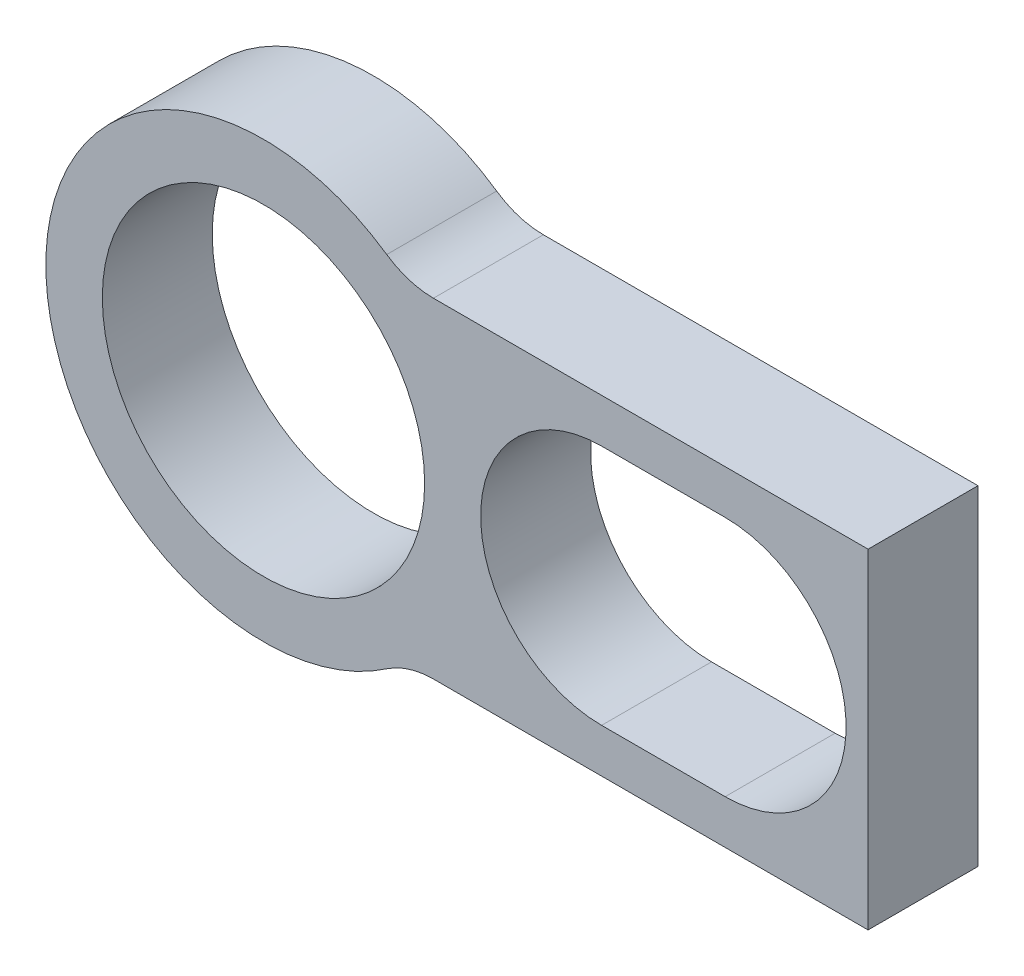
from build123d import *
from build123d.topology import SkipClean

# Parameters (mm, degrees)
SKETCH1_R          = 9.3726
EXTRUDE1_DEPTH     = 3.175
CUT_EXTRUDE2_DEPTH = 38.658444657
CUT_EXTRUDE1_DEPTH = 38.658444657
FILLET3_R          = 4.7625
FILLET4_R          = 4.7625
EXTRUDE3_START     = -6.35
EXTRUDE3_DEPTH     = 6.35


with BuildPart() as part:
    # Sketch1 → Extrude1 (new, symmetric)
    with BuildSketch(Plane.XY):
        with BuildLine():
            Line((0, 12.573), (34.925, 12.573))
            Line((34.925, 12.573), (34.925, -12.573))
            Line((34.925, -12.573), (0, -12.573))
            ThreePointArc((0, -12.573), (-12.573, 0), (0, 12.573))
        make_face()
        Circle(SKETCH1_R, mode=Mode.SUBTRACT)
    extrude(amount=EXTRUDE1_DEPTH, both=True)

    # Sketch7 → Cut-Extrude2 (cut, through all)
    with SkipClean():  # the faces are left unmerged after this step: merging them gives an invalid solid
        with BuildSketch(Plane(origin=(0, 0, -3.175), x_dir=(-1, 0, 0), z_dir=(0, 0, -1))):
            with BuildLine():
                Line((-34.925, 9.525), (-8.206991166, 9.525))
                ThreePointArc((-8.206991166, 9.525), (-4.377356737, 11.786393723), (0, 12.573))
                Line((0, 12.573), (-34.925, 12.573))
                Line((-34.925, 12.573), (-34.925, 9.525))
            make_face()
            with BuildLine():
                Line((-34.925, -12.573), (-34.925, -9.525))
                Line((-34.925, -9.525), (-8.206991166, -9.525))
                ThreePointArc((-8.206991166, -9.525), (-4.377356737, -11.786393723), (0, -12.573))
                Line((0, -12.573), (-34.925, -12.573))
            make_face()
        extrude(amount=-CUT_EXTRUDE2_DEPTH, mode=Mode.SUBTRACT)

    # Sketch6 → Cut-Extrude1 (cut, through all)
    with SkipClean():  # the faces are left unmerged after this step: merging them gives an invalid solid
        with BuildSketch(Plane(origin=(0, 0, -3.175), x_dir=(-1, 0, 0), z_dir=(0, 0, -1))):
            with BuildLine():
                Line((-26.67, 6.985), (-19.5326, 6.985))
                ThreePointArc((-19.5326, 6.985), (-12.5476, 0), (-19.5326, -6.985))
                Line((-19.5326, -6.985), (-26.67, -6.985))
                ThreePointArc((-26.67, -6.985), (-33.655, 0), (-26.67, 6.985))
            make_face()
        extrude(amount=-CUT_EXTRUDE1_DEPTH, mode=Mode.SUBTRACT)

    # Fillet3
    fillet3_edges = [part.edges().sort_by_distance(p)[0] for p in [
        (8.206991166, -9.525, 0),
    ]]
    fillet(fillet3_edges, radius=FILLET3_R)

    # Fillet4
    fillet4_edges = [part.edges().sort_by_distance(p)[0] for p in [
        (8.206991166, 9.525, 0),
    ]]
    fillet(fillet4_edges, radius=FILLET4_R)

    # Sketch8 → Extrude3 (add)
    with SkipClean():  # the faces are left unmerged after this step: merging them gives an invalid solid
        with BuildSketch(Plane.XY.offset(3.175).offset(EXTRUDE3_START)):
            with BuildLine():
                ThreePointArc((0, 9.3726), (-9.3726, 0), (0, -9.3726))
                ThreePointArc((0, -9.3726), (9.3726, 0), (0, 9.3726))
            make_face()
            with BuildLine():
                ThreePointArc((0, 9.3091), (-9.3091, 0), (0, -9.3091))
                ThreePointArc((0, -9.3091), (9.3091, 0), (0, 9.3091))
            make_face(mode=Mode.SUBTRACT)
        extrude(amount=EXTRUDE3_DEPTH)


solid = part.part
